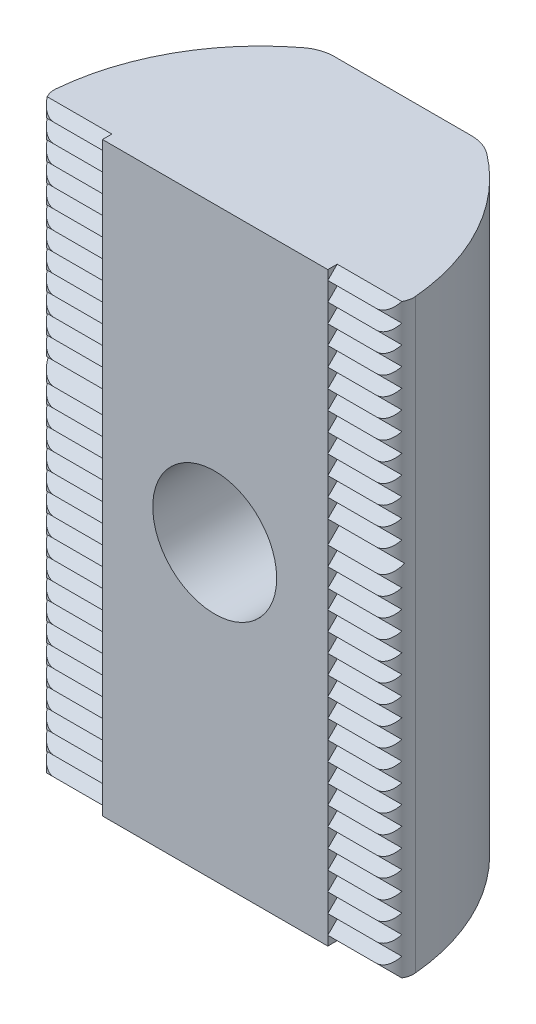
from build123d import *

# Parameters (mm, degrees)
EXTRUDE_1_DEPTH     = 7.8
M4X0_7_1_D          = 3.3
CUT_EXTRUDE_2_DEPTH = 13.103697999
CUT_EXTRUDE_3_DEPTH = 13.103697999


with BuildPart() as part:
    # Sketch 1 → Extrude 1 (new, symmetric)
    with BuildSketch(Plane.XZ):
        with BuildLine():
            Line((-4.28842123, 0), (4.28842123, 0))
            ThreePointArc((4.28842123, 0), (4.657211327, -0.162370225), (4.786479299, -0.54402454))
            ThreePointArc((4.786479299, -0.54402454), (4.060490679, -2.919187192), (2.434814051, -4.796853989))
            ThreePointArc((2.434814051, -4.796853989), (2.149347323, -4.947853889), (1.830642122, -5))
            Line((1.830642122, -5), (-1.830642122, -5))
            ThreePointArc((-1.830642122, -5), (-2.149347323, -4.947853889), (-2.434814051, -4.796853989))
            ThreePointArc((-2.434814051, -4.796853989), (-4.060490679, -2.919187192), (-4.786479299, -0.54402454))
            ThreePointArc((-4.786479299, -0.54402454), (-4.657211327, -0.162370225), (-4.28842123, 0))
        make_face()
    extrude(amount=EXTRUDE_1_DEPTH, both=True)

    # M4x0.7 _1 (through all)
    with Locations(Plane(origin=(1.337388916, 5.214464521, 0), x_dir=(1, 0, 0), z_dir=(0, 0, 1))):
        with Locations((-1.348967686, -5.214464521)):
            Hole(M4X0_7_1_D / 2)

    # Sketch 4 → Cut-Extrude 2 (cut, through all)
    with BuildSketch(Plane(origin=(3, 0, 0), x_dir=(0, 0, -1), z_dir=(1, 0, 0))):
        Polygon((0.25, -7.8), (-2.012448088, -7.8), (-2.012448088, 7.8), (0.25, 7.8), (0, 7.55), (0.25, 7.3), (0, 7.05), (0.25, 6.8), (0, 6.55), (0.25, 6.3), (0, 6.05), (0.25, 5.8), (0, 5.55), (0.25, 5.3), (0, 5.05), (0.25, 4.8), (0, 4.55), (0.25, 4.3), (0, 4.05), (0.25, 3.8), (0, 3.55), (0.25, 3.3), (0, 3.05), (0.25, 2.8), (0, 2.55), (0.25, 2.3), (0, 2.05), (0.3, 1.75), (0, 1.45), (0.25, 1.2), (0, 0.95), (0.25, 0.7), (0, 0.45), (0.25, 0.2), (0, -0.05), (0.25, -0.3), (0, -0.55), (0.25, -0.8), (0, -1.05), (0.25, -1.3), (0, -1.55), (0.25, -1.8), (0, -2.05), (0.25, -2.3), (0, -2.55), (0.25, -2.8), (0, -3.05), (0.25, -3.3), (0, -3.55), (0.25, -3.8), (0, -4.05), (0.25, -4.3), (0, -4.55), (0.25, -4.8), (0, -5.05), (0.25, -5.3), (0, -5.55), (0.25, -5.8), (0, -6.05), (0.25, -6.3), (0, -6.55), (0.25, -6.8), (0, -7.05), (0.25, -7.3), (0, -7.55), align=None)
    extrude(amount=CUT_EXTRUDE_2_DEPTH, mode=Mode.SUBTRACT)

    # Sketch 5 → Cut-Extrude 3 (cut, through all)
    with BuildSketch(Plane(origin=(-3, 0, 0), x_dir=(0, 0, -1), z_dir=(1, 0, 0))):
        Polygon((-2.012448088, 7.8), (0.25, 7.8), (0, 7.55), (0.25, 7.3), (0, 7.05), (0.25, 6.8), (0, 6.55), (0.25, 6.3), (0, 6.05), (0.25, 5.8), (0, 5.55), (0.25, 5.3), (0, 5.05), (0.25, 4.8), (0, 4.55), (0.25, 4.3), (0, 4.05), (0.25, 3.8), (0, 3.55), (0.25, 3.3), (0, 3.05), (0.25, 2.8), (0, 2.55), (0.25, 2.3), (0, 2.05), (0.3, 1.75), (0, 1.45), (0.25, 1.2), (0, 0.95), (0.25, 0.7), (0, 0.45), (0.25, 0.2), (0, -0.05), (0.25, -0.3), (0, -0.55), (0.25, -0.8), (0, -1.05), (0.25, -1.3), (0, -1.55), (0.25, -1.8), (0, -2.05), (0.25, -2.3), (0, -2.55), (0.25, -2.8), (0, -3.05), (0.25, -3.3), (0, -3.55), (0.25, -3.8), (0, -4.05), (0.25, -4.3), (0, -4.55), (0.25, -4.8), (0, -5.05), (0.25, -5.3), (0, -5.55), (0.25, -5.8), (0, -6.05), (0.25, -6.3), (0, -6.55), (0.25, -6.8), (0, -7.05), (0.25, -7.3), (0, -7.55), (0.25, -7.8), (-2.012448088, -7.8), align=None)
    extrude(amount=-CUT_EXTRUDE_3_DEPTH, mode=Mode.SUBTRACT)


solid = part.part
